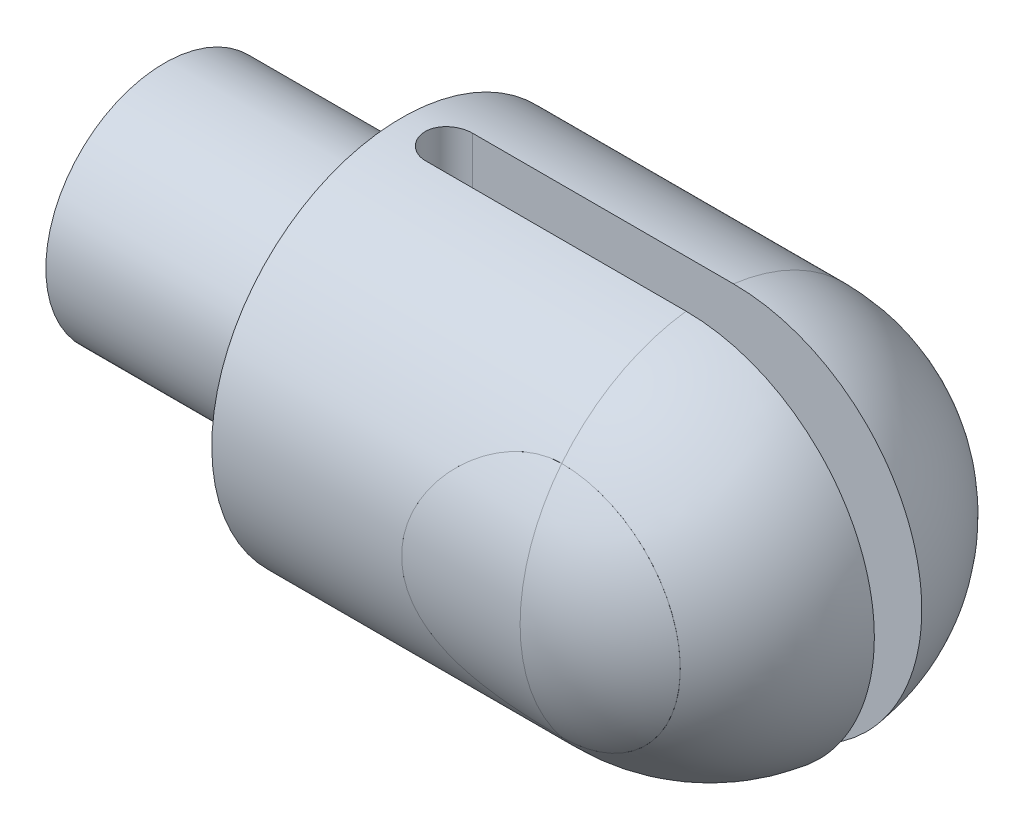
from build123d import *

# Parameters (mm, degrees)
SKETCH_3_R          = 5
EXTRUDE_2_DEPTH     = 10
SKETCH_4_R          = 8
EXTRUDE_3_DEPTH     = 20.94
CUT_EXTRUDE_2_DEPTH = 10.47
SKETCH_6_R          = 5
CUT_EXTRUDE_3_DEPTH = 10.47
SKETCH_7_R          = 5
EXTRUDE_4_DEPTH     = 10.47


with BuildPart() as part:
    # Sketch 3 → Extrude 2 (new body)
    with BuildSketch(Plane(origin=(0, 0, 0), x_dir=(0, 0, -1), z_dir=(1, 0, 0))):
        Circle(SKETCH_3_R)
    extrude(amount=EXTRUDE_2_DEPTH)

    # Sketch 4 → Extrude 3 (add)
    with BuildSketch(Plane(origin=(10, 0, 0), x_dir=(0, 0, -1), z_dir=(1, 0, 0))):
        Circle(SKETCH_4_R)
    extrude(amount=EXTRUDE_3_DEPTH)

    # Sketch 5 → Cut-Extrude 2 (cut, symmetric)
    with BuildSketch(Plane(origin=(0, 0, 0), x_dir=(1, 0, 0), z_dir=(0, 1, 0))):
        with BuildLine():
            Line((12, 1), (30.94, 1))
            Line((30.94, 1), (30.94, -1))
            Line((30.94, -1), (12, -1))
            ThreePointArc((12, -1), (11, 0), (12, 1))
        make_face()
    extrude(amount=CUT_EXTRUDE_2_DEPTH, both=True, mode=Mode.SUBTRACT)

    # Sketch 6 → Cut-Extrude 3 (cut, symmetric)
    with BuildSketch(Plane.XY):
        with Locations((23.002746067, 0)):
            Circle(SKETCH_6_R)
    extrude(amount=CUT_EXTRUDE_3_DEPTH, both=True, mode=Mode.SUBTRACT)


with BuildPart() as body_2:
    # Sketch 7 → Extrude 4 (new, symmetric)
    with BuildSketch(Plane.XY):
        with Locations((23.002746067, 0)):
            Circle(SKETCH_7_R)
    extrude(amount=EXTRUDE_4_DEPTH, both=True)


with BuildPart() as cut_revolve_7_tool:
    # Sketch 8 → Cut-Revolve 7 (revolve)
    with BuildSketch(Plane.XY):
        with BuildLine():
            Line((31.002746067, 0), (36.002746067, 0))
            Line((36.002746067, 0), (36.002746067, 13))
            Line((36.002746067, 13), (10, 13))
            Line((10, 13), (10, 8))
            Line((10, 8), (23.002746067, 8))
            ThreePointArc((23.002746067, 8), (28.659600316, 5.656854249), (31.002746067, 0))
        make_face()
    revolve(axis=Axis((0, 0, 0), (1, 0, 0)))


with BuildPart() as part_1:
    add(part.part)

    # Cut-Revolve 7: cut by cut_revolve_7_tool
    add(cut_revolve_7_tool.part, mode=Mode.SUBTRACT)


with BuildPart() as body_2_1:
    add(body_2.part)

    # Cut-Revolve 7: cut by cut_revolve_7_tool
    add(cut_revolve_7_tool.part, mode=Mode.SUBTRACT)


solid = Compound([part_1.part, body_2_1.part])
